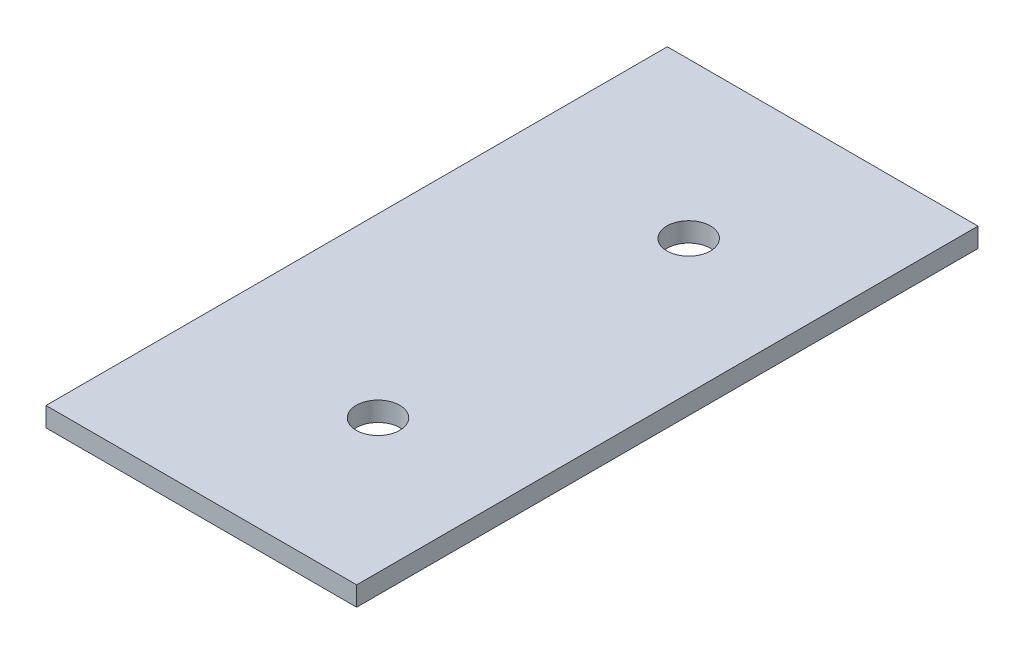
ISO-10303-21;
HEADER;
FILE_DESCRIPTION(('STEP AP214'),'2;1');
FILE_NAME('part.step','',(''),(''),'','','');
FILE_SCHEMA(('AUTOMOTIVE_DESIGN { 1 0 10303 214 1 1 1 1 }'));
ENDSEC;
DATA;
#1=APPLICATION_CONTEXT('core data for automotive mechanical design processes');
#2=APPLICATION_PROTOCOL_DEFINITION('international standard','automotive_design',2000,#1);
#3=PRODUCT_CONTEXT('',#1,'mechanical');
#4=PRODUCT('Part','Part','',(#3));
#5=PRODUCT_RELATED_PRODUCT_CATEGORY('part','',(#4));
#6=PRODUCT_DEFINITION_FORMATION('','',#4);
#7=PRODUCT_DEFINITION_CONTEXT('part definition',#1,'design');
#8=PRODUCT_DEFINITION('design','',#6,#7);
#9=PRODUCT_DEFINITION_SHAPE('','',#8);
#10=(LENGTH_UNIT() NAMED_UNIT(*) SI_UNIT(.MILLI.,.METRE.));
#11=(NAMED_UNIT(*) PLANE_ANGLE_UNIT() SI_UNIT($,.RADIAN.));
#12=(NAMED_UNIT(*) SI_UNIT($,.STERADIAN.) SOLID_ANGLE_UNIT());
#13=UNCERTAINTY_MEASURE_WITH_UNIT(LENGTH_MEASURE(1.E-05),#10,'distance_accuracy_value','');
#14=(GEOMETRIC_REPRESENTATION_CONTEXT(3) GLOBAL_UNCERTAINTY_ASSIGNED_CONTEXT((#13)) GLOBAL_UNIT_ASSIGNED_CONTEXT((#10,
#11,#12)) REPRESENTATION_CONTEXT('',''));
#15=CARTESIAN_POINT('',(0.,0.,0.));
#16=DIRECTION('',(0.,0.,1.));
#17=DIRECTION('',(1.,0.,0.));
#18=AXIS2_PLACEMENT_3D('',#15,#16,#17);
#19=CARTESIAN_POINT('',(0.,-1.5875,0.));
#20=DIRECTION('',(-1.,0.,0.));
#21=DIRECTION('',(0.,0.,1.));
#22=AXIS2_PLACEMENT_3D('',#19,#20,#21);
#23=PLANE('',#22);
#24=DIRECTION('',(0.,0.,1.));
#25=VECTOR('',#24,1.);
#26=CARTESIAN_POINT('',(0.,0.,0.));
#27=LINE('',#26,#25);
#28=CARTESIAN_POINT('',(0.,0.,-50.8));
#29=VERTEX_POINT('',#28);
#30=CARTESIAN_POINT('',(0.,0.,0.));
#31=VERTEX_POINT('',#30);
#32=EDGE_CURVE('E103',#29,#31,#27,.T.);
#33=ORIENTED_EDGE('',*,*,#32,.F.);
#34=DIRECTION('',(0.,1.,0.));
#35=VECTOR('',#34,1.);
#36=CARTESIAN_POINT('',(0.,-1.5875,-50.8));
#37=LINE('',#36,#35);
#38=CARTESIAN_POINT('',(0.,-1.5875,-50.8));
#39=VERTEX_POINT('',#38);
#40=EDGE_CURVE('E11',#39,#29,#37,.T.);
#41=ORIENTED_EDGE('',*,*,#40,.F.);
#42=DIRECTION('',(0.,0.,1.));
#43=VECTOR('',#42,1.);
#44=CARTESIAN_POINT('',(0.,-1.5875,0.));
#45=LINE('',#44,#43);
#46=CARTESIAN_POINT('',(0.,-1.5875,0.));
#47=VERTEX_POINT('',#46);
#48=EDGE_CURVE('E96',#39,#47,#45,.T.);
#49=ORIENTED_EDGE('',*,*,#48,.T.);
#50=DIRECTION('',(0.,1.,0.));
#51=VECTOR('',#50,1.);
#52=CARTESIAN_POINT('',(0.,-1.5875,0.));
#53=LINE('',#52,#51);
#54=EDGE_CURVE('E41',#47,#31,#53,.T.);
#55=ORIENTED_EDGE('',*,*,#54,.T.);
#56=EDGE_LOOP('',(#33,#41,#49,#55));
#57=FACE_BOUND('',#56,.T.);
#58=ADVANCED_FACE('F38',(#57),#23,.T.);
#59=CARTESIAN_POINT('',(0.,-1.5875,-50.8));
#60=DIRECTION('',(0.,0.,-1.));
#61=DIRECTION('',(-1.,0.,0.));
#62=AXIS2_PLACEMENT_3D('',#59,#60,#61);
#63=PLANE('',#62);
#64=DIRECTION('',(-1.,0.,0.));
#65=VECTOR('',#64,1.);
#66=CARTESIAN_POINT('',(0.,0.,-50.8));
#67=LINE('',#66,#65);
#68=CARTESIAN_POINT('',(25.4,0.,-50.8));
#69=VERTEX_POINT('',#68);
#70=EDGE_CURVE('E98',#69,#29,#67,.T.);
#71=ORIENTED_EDGE('',*,*,#70,.F.);
#72=DIRECTION('',(0.,1.,0.));
#73=VECTOR('',#72,1.);
#74=CARTESIAN_POINT('',(25.4,-1.5875,-50.8));
#75=LINE('',#74,#73);
#76=CARTESIAN_POINT('',(25.4,-1.5875,-50.8));
#77=VERTEX_POINT('',#76);
#78=EDGE_CURVE('E47',#77,#69,#75,.T.);
#79=ORIENTED_EDGE('',*,*,#78,.F.);
#80=DIRECTION('',(-1.,0.,0.));
#81=VECTOR('',#80,1.);
#82=CARTESIAN_POINT('',(0.,-1.5875,-50.8));
#83=LINE('',#82,#81);
#84=EDGE_CURVE('E93',#77,#39,#83,.T.);
#85=ORIENTED_EDGE('',*,*,#84,.T.);
#86=ORIENTED_EDGE('',*,*,#40,.T.);
#87=EDGE_LOOP('',(#71,#79,#85,#86));
#88=FACE_BOUND('',#87,.T.);
#89=ADVANCED_FACE('F114',(#88),#63,.T.);
#90=CARTESIAN_POINT('',(25.4,-1.5875,0.));
#91=DIRECTION('',(1.,0.,0.));
#92=DIRECTION('',(0.,0.,-1.));
#93=AXIS2_PLACEMENT_3D('',#90,#91,#92);
#94=PLANE('',#93);
#95=DIRECTION('',(0.,0.,-1.));
#96=VECTOR('',#95,1.);
#97=CARTESIAN_POINT('',(25.4,0.,0.));
#98=LINE('',#97,#96);
#99=CARTESIAN_POINT('',(25.4,0.,0.));
#100=VERTEX_POINT('',#99);
#101=EDGE_CURVE('E88',#100,#69,#98,.T.);
#102=ORIENTED_EDGE('',*,*,#101,.F.);
#103=DIRECTION('',(0.,1.,0.));
#104=VECTOR('',#103,1.);
#105=CARTESIAN_POINT('',(25.4,-1.5875,0.));
#106=LINE('',#105,#104);
#107=CARTESIAN_POINT('',(25.4,-1.5875,0.));
#108=VERTEX_POINT('',#107);
#109=EDGE_CURVE('E83',#108,#100,#106,.T.);
#110=ORIENTED_EDGE('',*,*,#109,.F.);
#111=DIRECTION('',(0.,0.,-1.));
#112=VECTOR('',#111,1.);
#113=CARTESIAN_POINT('',(25.4,-1.5875,0.));
#114=LINE('',#113,#112);
#115=EDGE_CURVE('E86',#108,#77,#114,.T.);
#116=ORIENTED_EDGE('',*,*,#115,.T.);
#117=ORIENTED_EDGE('',*,*,#78,.T.);
#118=EDGE_LOOP('',(#102,#110,#116,#117));
#119=FACE_BOUND('',#118,.T.);
#120=ADVANCED_FACE('F85',(#119),#94,.T.);
#121=CARTESIAN_POINT('',(0.,-1.5875,0.));
#122=DIRECTION('',(0.,0.,1.));
#123=DIRECTION('',(1.,0.,0.));
#124=AXIS2_PLACEMENT_3D('',#121,#122,#123);
#125=PLANE('',#124);
#126=DIRECTION('',(1.,0.,0.));
#127=VECTOR('',#126,1.);
#128=CARTESIAN_POINT('',(0.,0.,0.));
#129=LINE('',#128,#127);
#130=EDGE_CURVE('E106',#31,#100,#129,.T.);
#131=ORIENTED_EDGE('',*,*,#130,.F.);
#132=ORIENTED_EDGE('',*,*,#54,.F.);
#133=DIRECTION('',(1.,0.,0.));
#134=VECTOR('',#133,1.);
#135=CARTESIAN_POINT('',(0.,-1.5875,0.));
#136=LINE('',#135,#134);
#137=EDGE_CURVE('E92',#47,#108,#136,.T.);
#138=ORIENTED_EDGE('',*,*,#137,.T.);
#139=ORIENTED_EDGE('',*,*,#109,.T.);
#140=EDGE_LOOP('',(#131,#132,#138,#139));
#141=FACE_BOUND('',#140,.T.);
#142=ADVANCED_FACE('F95',(#141),#125,.T.);
#143=CARTESIAN_POINT('',(0.,-1.5875,0.));
#144=DIRECTION('',(0.,-1.,0.));
#145=DIRECTION('',(0.,0.,-1.));
#146=AXIS2_PLACEMENT_3D('',#143,#144,#145);
#147=PLANE('',#146);
#148=CARTESIAN_POINT('',(14.4462499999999,-1.5875,-12.7));
#149=DIRECTION('',(0.,1.,0.));
#150=DIRECTION('',(0.,0.,1.));
#151=AXIS2_PLACEMENT_3D('',#148,#149,#150);
#152=CIRCLE('',#151,1.778);
#153=CARTESIAN_POINT('',(14.4462499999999,-1.5875,-10.922));
#154=VERTEX_POINT('',#153);
#155=EDGE_CURVE('E107',#154,#154,#152,.T.);
#156=ORIENTED_EDGE('',*,*,#155,.T.);
#157=EDGE_LOOP('',(#156));
#158=FACE_BOUND('',#157,.T.);
#159=CARTESIAN_POINT('',(14.44625,-1.5875,-38.1));
#160=DIRECTION('',(0.,1.,0.));
#161=DIRECTION('',(0.,0.,1.));
#162=AXIS2_PLACEMENT_3D('',#159,#160,#161);
#163=CIRCLE('',#162,1.778);
#164=CARTESIAN_POINT('',(14.44625,-1.5875,-36.322));
#165=VERTEX_POINT('',#164);
#166=EDGE_CURVE('E150',#165,#165,#163,.T.);
#167=ORIENTED_EDGE('',*,*,#166,.T.);
#168=EDGE_LOOP('',(#167));
#169=FACE_BOUND('',#168,.T.);
#170=ORIENTED_EDGE('',*,*,#48,.F.);
#171=ORIENTED_EDGE('',*,*,#84,.F.);
#172=ORIENTED_EDGE('',*,*,#115,.F.);
#173=ORIENTED_EDGE('',*,*,#137,.F.);
#174=EDGE_LOOP('',(#170,#171,#172,#173));
#175=FACE_BOUND('',#174,.T.);
#176=ADVANCED_FACE('F91',(#158,#169,#175),#147,.T.);
#177=CARTESIAN_POINT('',(0.,0.,0.));
#178=DIRECTION('',(0.,-1.,0.));
#179=DIRECTION('',(0.,0.,-1.));
#180=AXIS2_PLACEMENT_3D('',#177,#178,#179);
#181=PLANE('',#180);
#182=CARTESIAN_POINT('',(14.4462499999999,0.,-12.7));
#183=DIRECTION('',(0.,1.,0.));
#184=DIRECTION('',(0.,0.,1.));
#185=AXIS2_PLACEMENT_3D('',#182,#183,#184);
#186=CIRCLE('',#185,1.778);
#187=CARTESIAN_POINT('',(14.4462499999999,0.,-10.922));
#188=VERTEX_POINT('',#187);
#189=EDGE_CURVE('E149',#188,#188,#186,.T.);
#190=ORIENTED_EDGE('',*,*,#189,.F.);
#191=EDGE_LOOP('',(#190));
#192=FACE_BOUND('',#191,.T.);
#193=CARTESIAN_POINT('',(14.44625,0.,-38.1));
#194=DIRECTION('',(0.,1.,0.));
#195=DIRECTION('',(0.,0.,1.));
#196=AXIS2_PLACEMENT_3D('',#193,#194,#195);
#197=CIRCLE('',#196,1.778);
#198=CARTESIAN_POINT('',(14.44625,0.,-36.322));
#199=VERTEX_POINT('',#198);
#200=EDGE_CURVE('E154',#199,#199,#197,.T.);
#201=ORIENTED_EDGE('',*,*,#200,.F.);
#202=EDGE_LOOP('',(#201));
#203=FACE_BOUND('',#202,.T.);
#204=ORIENTED_EDGE('',*,*,#32,.T.);
#205=ORIENTED_EDGE('',*,*,#130,.T.);
#206=ORIENTED_EDGE('',*,*,#101,.T.);
#207=ORIENTED_EDGE('',*,*,#70,.T.);
#208=EDGE_LOOP('',(#204,#205,#206,#207));
#209=FACE_BOUND('',#208,.T.);
#210=ADVANCED_FACE('F113',(#192,#203,#209),#181,.F.);
#211=CARTESIAN_POINT('',(14.44625,-1.5875,-38.1));
#212=DIRECTION('',(0.,1.,0.));
#213=DIRECTION('',(0.,0.,1.));
#214=AXIS2_PLACEMENT_3D('',#211,#212,#213);
#215=CYLINDRICAL_SURFACE('',#214,1.778);
#216=ORIENTED_EDGE('',*,*,#166,.F.);
#217=EDGE_LOOP('',(#216));
#218=FACE_BOUND('',#217,.T.);
#219=ORIENTED_EDGE('',*,*,#200,.T.);
#220=EDGE_LOOP('',(#219));
#221=FACE_BOUND('',#220,.T.);
#222=ADVANCED_FACE('F132',(#218,#221),#215,.F.);
#223=CARTESIAN_POINT('',(14.4462499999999,-1.5875,-12.7));
#224=DIRECTION('',(0.,1.,0.));
#225=DIRECTION('',(0.,0.,1.));
#226=AXIS2_PLACEMENT_3D('',#223,#224,#225);
#227=CYLINDRICAL_SURFACE('',#226,1.778);
#228=ORIENTED_EDGE('',*,*,#155,.F.);
#229=EDGE_LOOP('',(#228));
#230=FACE_BOUND('',#229,.T.);
#231=ORIENTED_EDGE('',*,*,#189,.T.);
#232=EDGE_LOOP('',(#231));
#233=FACE_BOUND('',#232,.T.);
#234=ADVANCED_FACE('F139',(#230,#233),#227,.F.);
#235=CLOSED_SHELL('',(#58,#89,#120,#142,#176,#210,#222,#234));
#236=MANIFOLD_SOLID_BREP('B2',#235);
#237=ADVANCED_BREP_SHAPE_REPRESENTATION('',(#18,#236),#14);
#238=SHAPE_DEFINITION_REPRESENTATION(#9,#237);
ENDSEC;
END-ISO-10303-21;
